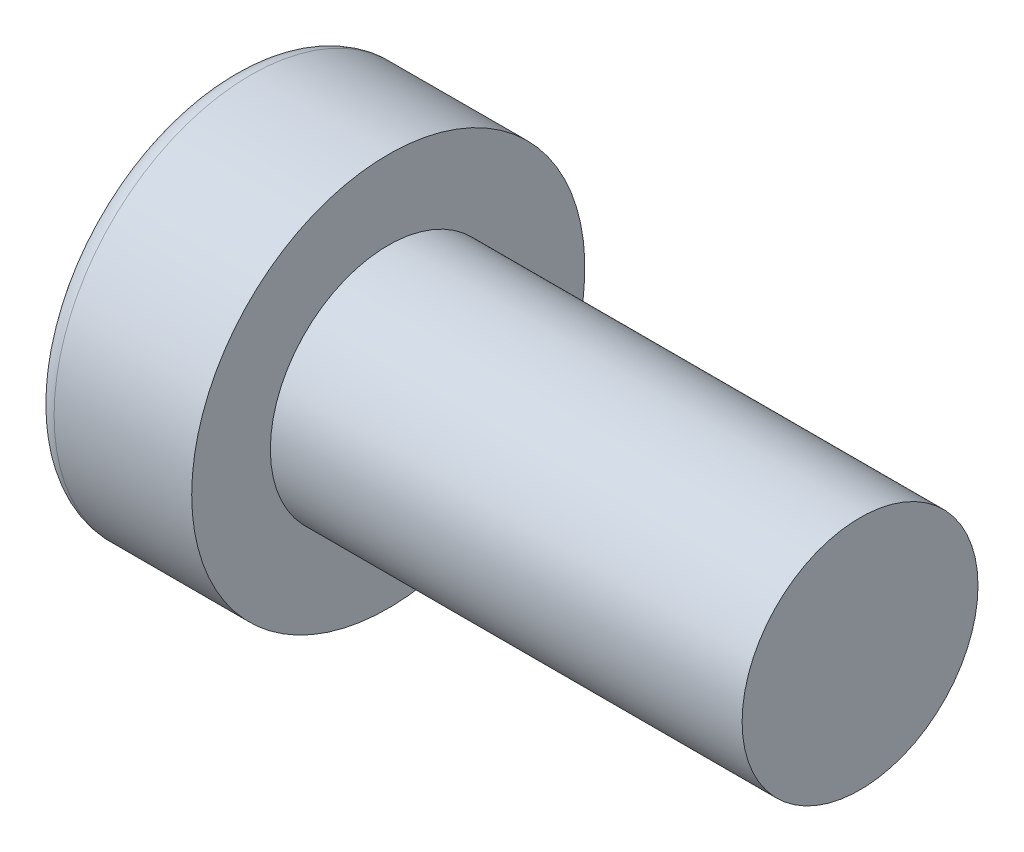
ISO-10303-21;
HEADER;
FILE_DESCRIPTION(('STEP AP214'),'2;1');
FILE_NAME('part.step','',(''),(''),'','','');
FILE_SCHEMA(('AUTOMOTIVE_DESIGN { 1 0 10303 214 1 1 1 1 }'));
ENDSEC;
DATA;
#1=APPLICATION_CONTEXT('core data for automotive mechanical design processes');
#2=APPLICATION_PROTOCOL_DEFINITION('international standard','automotive_design',2000,#1);
#3=PRODUCT_CONTEXT('',#1,'mechanical');
#4=PRODUCT('Part','Part','',(#3));
#5=PRODUCT_RELATED_PRODUCT_CATEGORY('part','',(#4));
#6=PRODUCT_DEFINITION_FORMATION('','',#4);
#7=PRODUCT_DEFINITION_CONTEXT('part definition',#1,'design');
#8=PRODUCT_DEFINITION('design','',#6,#7);
#9=PRODUCT_DEFINITION_SHAPE('','',#8);
#10=(LENGTH_UNIT() NAMED_UNIT(*) SI_UNIT(.MILLI.,.METRE.));
#11=(NAMED_UNIT(*) PLANE_ANGLE_UNIT() SI_UNIT($,.RADIAN.));
#12=(NAMED_UNIT(*) SI_UNIT($,.STERADIAN.) SOLID_ANGLE_UNIT());
#13=UNCERTAINTY_MEASURE_WITH_UNIT(LENGTH_MEASURE(1.E-05),#10,'distance_accuracy_value','');
#14=(GEOMETRIC_REPRESENTATION_CONTEXT(3) GLOBAL_UNCERTAINTY_ASSIGNED_CONTEXT((#13)) GLOBAL_UNIT_ASSIGNED_CONTEXT((#10,
#11,#12)) REPRESENTATION_CONTEXT('',''));
#15=CARTESIAN_POINT('',(0.,0.,0.));
#16=DIRECTION('',(0.,0.,1.));
#17=DIRECTION('',(1.,0.,0.));
#18=AXIS2_PLACEMENT_3D('',#15,#16,#17);
#19=CARTESIAN_POINT('',(-12.,5.,0.));
#20=DIRECTION('',(-1.,0.,0.));
#21=DIRECTION('',(0.,0.,1.));
#22=AXIS2_PLACEMENT_3D('',#19,#20,#21);
#23=PLANE('',#22);
#24=CARTESIAN_POINT('',(-12.,0.,0.));
#25=DIRECTION('',(-1.,0.,0.));
#26=DIRECTION('',(0.,0.,1.));
#27=AXIS2_PLACEMENT_3D('',#24,#25,#26);
#28=CIRCLE('',#27,5.);
#29=CARTESIAN_POINT('',(-12.,0.,5.));
#30=VERTEX_POINT('',#29);
#31=EDGE_CURVE('E148',#30,#30,#28,.T.);
#32=ORIENTED_EDGE('',*,*,#31,.F.);
#33=EDGE_LOOP('',(#32));
#34=FACE_BOUND('',#33,.T.);
#35=CARTESIAN_POINT('',(-12.,0.,0.));
#36=DIRECTION('',(-1.,0.,0.));
#37=DIRECTION('',(0.,0.,1.));
#38=AXIS2_PLACEMENT_3D('',#35,#36,#37);
#39=CIRCLE('',#38,3.);
#40=CARTESIAN_POINT('',(-12.,0.,3.));
#41=VERTEX_POINT('',#40);
#42=EDGE_CURVE('E137',#41,#41,#39,.T.);
#43=ORIENTED_EDGE('',*,*,#42,.T.);
#44=EDGE_LOOP('',(#43));
#45=FACE_BOUND('',#44,.T.);
#46=ADVANCED_FACE('F35',(#34,#45),#23,.F.);
#47=CARTESIAN_POINT('',(-65.0118083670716,0.,0.));
#48=DIRECTION('',(-1.,0.,0.));
#49=DIRECTION('',(0.,0.,1.));
#50=AXIS2_PLACEMENT_3D('',#47,#48,#49);
#51=CYLINDRICAL_SURFACE('',#50,5.);
#52=CARTESIAN_POINT('',(-15.5,0.,0.));
#53=DIRECTION('',(1.,0.,0.));
#54=DIRECTION('',(0.,0.,-1.));
#55=AXIS2_PLACEMENT_3D('',#52,#53,#54);
#56=CIRCLE('',#55,5.);
#57=CARTESIAN_POINT('',(-15.5,0.,-5.));
#58=VERTEX_POINT('',#57);
#59=EDGE_CURVE('E11',#58,#58,#56,.T.);
#60=ORIENTED_EDGE('',*,*,#59,.T.);
#61=EDGE_LOOP('',(#60));
#62=FACE_BOUND('',#61,.T.);
#63=ORIENTED_EDGE('',*,*,#31,.T.);
#64=EDGE_LOOP('',(#63));
#65=FACE_BOUND('',#64,.T.);
#66=ADVANCED_FACE('F170',(#62,#65),#51,.T.);
#67=CARTESIAN_POINT('',(-16.,0.,0.));
#68=DIRECTION('',(1.,0.,0.));
#69=DIRECTION('',(0.,0.,-1.));
#70=AXIS2_PLACEMENT_3D('',#67,#68,#69);
#71=PLANE('',#70);
#72=DIRECTION('',(0.,0.5,-0.866025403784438));
#73=VECTOR('',#72,1.);
#74=CARTESIAN_POINT('',(-16.,1.15470053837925,2.));
#75=LINE('',#74,#73);
#76=CARTESIAN_POINT('',(-16.,1.15470053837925,2.));
#77=VERTEX_POINT('',#76);
#78=CARTESIAN_POINT('',(-16.,2.3094010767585,0.));
#79=VERTEX_POINT('',#78);
#80=EDGE_CURVE('E124',#77,#79,#75,.T.);
#81=ORIENTED_EDGE('',*,*,#80,.F.);
#82=DIRECTION('',(0.,1.,0.));
#83=VECTOR('',#82,1.);
#84=CARTESIAN_POINT('',(-16.,-1.15470053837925,2.));
#85=LINE('',#84,#83);
#86=CARTESIAN_POINT('',(-16.,-1.15470053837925,2.));
#87=VERTEX_POINT('',#86);
#88=EDGE_CURVE('E50',#87,#77,#85,.T.);
#89=ORIENTED_EDGE('',*,*,#88,.F.);
#90=DIRECTION('',(0.,0.5,0.866025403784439));
#91=VECTOR('',#90,1.);
#92=CARTESIAN_POINT('',(-16.,-2.3094010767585,0.));
#93=LINE('',#92,#91);
#94=CARTESIAN_POINT('',(-16.,-2.3094010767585,0.));
#95=VERTEX_POINT('',#94);
#96=EDGE_CURVE('E133',#95,#87,#93,.T.);
#97=ORIENTED_EDGE('',*,*,#96,.F.);
#98=DIRECTION('',(0.,-0.5,0.866025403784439));
#99=VECTOR('',#98,1.);
#100=CARTESIAN_POINT('',(-16.,-1.15470053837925,-2.));
#101=LINE('',#100,#99);
#102=CARTESIAN_POINT('',(-16.,-1.15470053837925,-2.));
#103=VERTEX_POINT('',#102);
#104=EDGE_CURVE('E131',#103,#95,#101,.T.);
#105=ORIENTED_EDGE('',*,*,#104,.F.);
#106=DIRECTION('',(0.,-1.,0.));
#107=VECTOR('',#106,1.);
#108=CARTESIAN_POINT('',(-16.,1.15470053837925,-2.));
#109=LINE('',#108,#107);
#110=CARTESIAN_POINT('',(-16.,1.15470053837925,-2.));
#111=VERTEX_POINT('',#110);
#112=EDGE_CURVE('E98',#111,#103,#109,.T.);
#113=ORIENTED_EDGE('',*,*,#112,.F.);
#114=DIRECTION('',(0.,-0.5,-0.866025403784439));
#115=VECTOR('',#114,1.);
#116=CARTESIAN_POINT('',(-16.,2.3094010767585,0.));
#117=LINE('',#116,#115);
#118=EDGE_CURVE('E127',#79,#111,#117,.T.);
#119=ORIENTED_EDGE('',*,*,#118,.F.);
#120=EDGE_LOOP('',(#81,#89,#97,#105,#113,#119));
#121=FACE_BOUND('',#120,.T.);
#122=CARTESIAN_POINT('',(-16.,0.,0.));
#123=DIRECTION('',(1.,0.,0.));
#124=DIRECTION('',(0.,0.,-1.));
#125=AXIS2_PLACEMENT_3D('',#122,#123,#124);
#126=CIRCLE('',#125,4.5);
#127=CARTESIAN_POINT('',(-16.,0.,-4.5));
#128=VERTEX_POINT('',#127);
#129=EDGE_CURVE('E43',#128,#128,#126,.F.);
#130=ORIENTED_EDGE('',*,*,#129,.T.);
#131=EDGE_LOOP('',(#130));
#132=FACE_BOUND('',#131,.T.);
#133=ADVANCED_FACE('F153',(#121,#132),#71,.F.);
#134=CARTESIAN_POINT('',(0.,3.,0.));
#135=DIRECTION('',(-1.,0.,0.));
#136=DIRECTION('',(0.,0.,1.));
#137=AXIS2_PLACEMENT_3D('',#134,#135,#136);
#138=PLANE('',#137);
#139=CARTESIAN_POINT('',(0.,0.,0.));
#140=DIRECTION('',(-1.,0.,0.));
#141=DIRECTION('',(0.,0.,1.));
#142=AXIS2_PLACEMENT_3D('',#139,#140,#141);
#143=CIRCLE('',#142,3.);
#144=CARTESIAN_POINT('',(0.,0.,3.));
#145=VERTEX_POINT('',#144);
#146=EDGE_CURVE('E145',#145,#145,#143,.T.);
#147=ORIENTED_EDGE('',*,*,#146,.F.);
#148=EDGE_LOOP('',(#147));
#149=FACE_BOUND('',#148,.T.);
#150=ADVANCED_FACE('F165',(#149),#138,.F.);
#151=CARTESIAN_POINT('',(-65.0118083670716,0.,0.));
#152=DIRECTION('',(-1.,0.,0.));
#153=DIRECTION('',(0.,0.,1.));
#154=AXIS2_PLACEMENT_3D('',#151,#152,#153);
#155=CYLINDRICAL_SURFACE('',#154,3.);
#156=ORIENTED_EDGE('',*,*,#42,.F.);
#157=EDGE_LOOP('',(#156));
#158=FACE_BOUND('',#157,.T.);
#159=ORIENTED_EDGE('',*,*,#146,.T.);
#160=EDGE_LOOP('',(#159));
#161=FACE_BOUND('',#160,.T.);
#162=ADVANCED_FACE('F157',(#158,#161),#155,.T.);
#163=CARTESIAN_POINT('',(-15.5,0.,0.));
#164=DIRECTION('',(1.,0.,0.));
#165=DIRECTION('',(0.,0.,-1.));
#166=AXIS2_PLACEMENT_3D('',#163,#164,#165);
#167=TOROIDAL_SURFACE('',#166,4.5,0.5);
#168=ORIENTED_EDGE('',*,*,#59,.F.);
#169=EDGE_LOOP('',(#168));
#170=FACE_BOUND('',#169,.T.);
#171=ORIENTED_EDGE('',*,*,#129,.F.);
#172=EDGE_LOOP('',(#171));
#173=FACE_BOUND('',#172,.T.);
#174=ADVANCED_FACE('F37',(#170,#173),#167,.T.);
#175=CARTESIAN_POINT('',(-13.,-1.15470053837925,2.));
#176=DIRECTION('',(0.,0.,1.));
#177=DIRECTION('',(1.,0.,0.));
#178=AXIS2_PLACEMENT_3D('',#175,#176,#177);
#179=PLANE('',#178);
#180=ORIENTED_EDGE('',*,*,#88,.T.);
#181=DIRECTION('',(-1.,0.,0.));
#182=VECTOR('',#181,1.);
#183=CARTESIAN_POINT('',(-13.,1.15470053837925,2.));
#184=LINE('',#183,#182);
#185=CARTESIAN_POINT('',(-13.,1.15470053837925,2.));
#186=VERTEX_POINT('',#185);
#187=EDGE_CURVE('E80',#186,#77,#184,.T.);
#188=ORIENTED_EDGE('',*,*,#187,.F.);
#189=DIRECTION('',(0.,1.,0.));
#190=VECTOR('',#189,1.);
#191=CARTESIAN_POINT('',(-13.,-1.15470053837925,2.));
#192=LINE('',#191,#190);
#193=CARTESIAN_POINT('',(-13.,-1.15470053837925,2.));
#194=VERTEX_POINT('',#193);
#195=EDGE_CURVE('E135',#194,#186,#192,.T.);
#196=ORIENTED_EDGE('',*,*,#195,.F.);
#197=DIRECTION('',(-1.,0.,0.));
#198=VECTOR('',#197,1.);
#199=CARTESIAN_POINT('',(-13.,-1.15470053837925,2.));
#200=LINE('',#199,#198);
#201=EDGE_CURVE('E58',#194,#87,#200,.T.);
#202=ORIENTED_EDGE('',*,*,#201,.T.);
#203=EDGE_LOOP('',(#180,#188,#196,#202));
#204=FACE_BOUND('',#203,.T.);
#205=ADVANCED_FACE('F156',(#204),#179,.F.);
#206=CARTESIAN_POINT('',(-13.,-2.3094010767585,0.));
#207=DIRECTION('',(0.,-0.866025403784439,0.5));
#208=DIRECTION('',(0.,-0.5,-0.866025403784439));
#209=AXIS2_PLACEMENT_3D('',#206,#207,#208);
#210=PLANE('',#209);
#211=ORIENTED_EDGE('',*,*,#96,.T.);
#212=ORIENTED_EDGE('',*,*,#201,.F.);
#213=DIRECTION('',(0.,0.5,0.866025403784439));
#214=VECTOR('',#213,1.);
#215=CARTESIAN_POINT('',(-13.,-2.3094010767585,0.));
#216=LINE('',#215,#214);
#217=CARTESIAN_POINT('',(-13.,-2.3094010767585,0.));
#218=VERTEX_POINT('',#217);
#219=EDGE_CURVE('E110',#218,#194,#216,.T.);
#220=ORIENTED_EDGE('',*,*,#219,.F.);
#221=DIRECTION('',(-1.,0.,0.));
#222=VECTOR('',#221,1.);
#223=CARTESIAN_POINT('',(-13.,-2.3094010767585,0.));
#224=LINE('',#223,#222);
#225=EDGE_CURVE('E102',#218,#95,#224,.T.);
#226=ORIENTED_EDGE('',*,*,#225,.T.);
#227=EDGE_LOOP('',(#211,#212,#220,#226));
#228=FACE_BOUND('',#227,.T.);
#229=ADVANCED_FACE('F163',(#228),#210,.F.);
#230=CARTESIAN_POINT('',(-13.,-1.15470053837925,-2.));
#231=DIRECTION('',(0.,-0.866025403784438,-0.5));
#232=DIRECTION('',(0.,0.5,-0.866025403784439));
#233=AXIS2_PLACEMENT_3D('',#230,#231,#232);
#234=PLANE('',#233);
#235=ORIENTED_EDGE('',*,*,#104,.T.);
#236=ORIENTED_EDGE('',*,*,#225,.F.);
#237=DIRECTION('',(0.,-0.5,0.866025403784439));
#238=VECTOR('',#237,1.);
#239=CARTESIAN_POINT('',(-13.,-1.15470053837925,-2.));
#240=LINE('',#239,#238);
#241=CARTESIAN_POINT('',(-13.,-1.15470053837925,-2.));
#242=VERTEX_POINT('',#241);
#243=EDGE_CURVE('E106',#242,#218,#240,.T.);
#244=ORIENTED_EDGE('',*,*,#243,.F.);
#245=DIRECTION('',(-1.,0.,0.));
#246=VECTOR('',#245,1.);
#247=CARTESIAN_POINT('',(-13.,-1.15470053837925,-2.));
#248=LINE('',#247,#246);
#249=EDGE_CURVE('E91',#242,#103,#248,.T.);
#250=ORIENTED_EDGE('',*,*,#249,.T.);
#251=EDGE_LOOP('',(#235,#236,#244,#250));
#252=FACE_BOUND('',#251,.T.);
#253=ADVANCED_FACE('F107',(#252),#234,.F.);
#254=CARTESIAN_POINT('',(-13.,1.15470053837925,-2.));
#255=DIRECTION('',(0.,0.,-1.));
#256=DIRECTION('',(-1.,0.,0.));
#257=AXIS2_PLACEMENT_3D('',#254,#255,#256);
#258=PLANE('',#257);
#259=ORIENTED_EDGE('',*,*,#112,.T.);
#260=ORIENTED_EDGE('',*,*,#249,.F.);
#261=DIRECTION('',(0.,-1.,0.));
#262=VECTOR('',#261,1.);
#263=CARTESIAN_POINT('',(-13.,1.15470053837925,-2.));
#264=LINE('',#263,#262);
#265=CARTESIAN_POINT('',(-13.,1.15470053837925,-2.));
#266=VERTEX_POINT('',#265);
#267=EDGE_CURVE('E95',#266,#242,#264,.T.);
#268=ORIENTED_EDGE('',*,*,#267,.F.);
#269=DIRECTION('',(-1.,0.,0.));
#270=VECTOR('',#269,1.);
#271=CARTESIAN_POINT('',(-13.,1.15470053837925,-2.));
#272=LINE('',#271,#270);
#273=EDGE_CURVE('E103',#266,#111,#272,.T.);
#274=ORIENTED_EDGE('',*,*,#273,.T.);
#275=EDGE_LOOP('',(#259,#260,#268,#274));
#276=FACE_BOUND('',#275,.T.);
#277=ADVANCED_FACE('F93',(#276),#258,.F.);
#278=CARTESIAN_POINT('',(-13.,2.3094010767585,0.));
#279=DIRECTION('',(0.,0.866025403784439,-0.5));
#280=DIRECTION('',(0.,0.5,0.866025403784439));
#281=AXIS2_PLACEMENT_3D('',#278,#279,#280);
#282=PLANE('',#281);
#283=ORIENTED_EDGE('',*,*,#118,.T.);
#284=ORIENTED_EDGE('',*,*,#273,.F.);
#285=DIRECTION('',(0.,-0.5,-0.866025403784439));
#286=VECTOR('',#285,1.);
#287=CARTESIAN_POINT('',(-13.,2.3094010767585,0.));
#288=LINE('',#287,#286);
#289=CARTESIAN_POINT('',(-13.,2.3094010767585,0.));
#290=VERTEX_POINT('',#289);
#291=EDGE_CURVE('E116',#290,#266,#288,.T.);
#292=ORIENTED_EDGE('',*,*,#291,.F.);
#293=DIRECTION('',(-1.,0.,0.));
#294=VECTOR('',#293,1.);
#295=CARTESIAN_POINT('',(-13.,2.3094010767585,0.));
#296=LINE('',#295,#294);
#297=EDGE_CURVE('E140',#290,#79,#296,.T.);
#298=ORIENTED_EDGE('',*,*,#297,.T.);
#299=EDGE_LOOP('',(#283,#284,#292,#298));
#300=FACE_BOUND('',#299,.T.);
#301=ADVANCED_FACE('F189',(#300),#282,.F.);
#302=CARTESIAN_POINT('',(-13.,1.15470053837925,2.));
#303=DIRECTION('',(0.,0.866025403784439,0.5));
#304=DIRECTION('',(0.,-0.5,0.866025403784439));
#305=AXIS2_PLACEMENT_3D('',#302,#303,#304);
#306=PLANE('',#305);
#307=ORIENTED_EDGE('',*,*,#80,.T.);
#308=ORIENTED_EDGE('',*,*,#297,.F.);
#309=DIRECTION('',(0.,0.5,-0.866025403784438));
#310=VECTOR('',#309,1.);
#311=CARTESIAN_POINT('',(-13.,1.15470053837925,2.));
#312=LINE('',#311,#310);
#313=EDGE_CURVE('E118',#186,#290,#312,.T.);
#314=ORIENTED_EDGE('',*,*,#313,.F.);
#315=ORIENTED_EDGE('',*,*,#187,.T.);
#316=EDGE_LOOP('',(#307,#308,#314,#315));
#317=FACE_BOUND('',#316,.T.);
#318=ADVANCED_FACE('F186',(#317),#306,.F.);
#319=CARTESIAN_POINT('',(-13.,0.,0.));
#320=DIRECTION('',(-1.,0.,0.));
#321=DIRECTION('',(0.,0.,1.));
#322=AXIS2_PLACEMENT_3D('',#319,#320,#321);
#323=PLANE('',#322);
#324=ORIENTED_EDGE('',*,*,#195,.T.);
#325=ORIENTED_EDGE('',*,*,#313,.T.);
#326=ORIENTED_EDGE('',*,*,#291,.T.);
#327=ORIENTED_EDGE('',*,*,#267,.T.);
#328=ORIENTED_EDGE('',*,*,#243,.T.);
#329=ORIENTED_EDGE('',*,*,#219,.T.);
#330=EDGE_LOOP('',(#324,#325,#326,#327,#328,#329));
#331=FACE_BOUND('',#330,.T.);
#332=ADVANCED_FACE('F113',(#331),#323,.T.);
#333=CLOSED_SHELL('',(#46,#66,#133,#150,#162,#174,#205,#229,#253,#277,#301,#318,#332));
#334=MANIFOLD_SOLID_BREP('B2',#333);
#335=ADVANCED_BREP_SHAPE_REPRESENTATION('',(#18,#334),#14);
#336=SHAPE_DEFINITION_REPRESENTATION(#9,#335);
ENDSEC;
END-ISO-10303-21;
